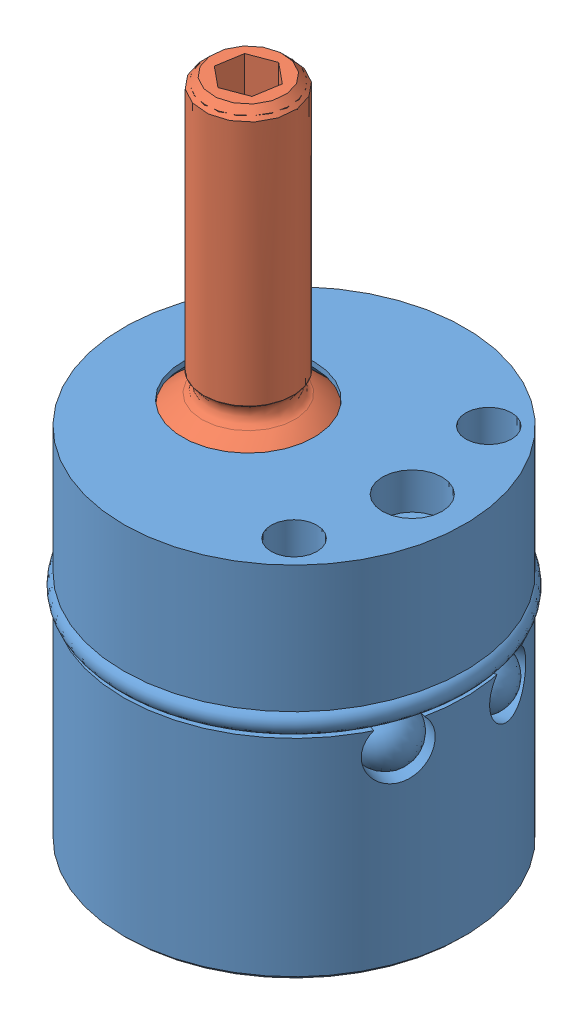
SolidWorks assembly ILC66091504.SLDASM, configuration Default (file format 5000). Lengths in mm.
Overall size (25.24 44.5 24.26).
2 component instances, 2 part files, 2 mates.
Components (placement in the parent):
- ILC66091504_BODY-1: ILC66091504_BODY.sldprt [Default] at (-2.9646 -12.5157 1.089) size (24.47 26.26 24.26)
- ILC66091504_PIVOT-1: ILC66091504_PIVOT.sldprt [Default] at (-6.1396 6.5851 1.089) x (-0.633993 0 0.773339) z (-0.773339 0 -0.633993) size (13.83 26.23 13.77)
Mates (geometry in assembly coordinates):
- Coincident1: coincident: axis of ILC66091504_BODY-1 through (-6.1396 12.4779 1.089) axis (0 -1 0); axis of ILC66091504_PIVOT-1 through (-6.1396 31.3501 1.089) axis (0 -1 0)
- Coincident2: coincident: plane of ILC66091504_BODY-1 through (-6.1396 6.5851 1.089) normal (0 1 0); plane of ILC66091504_PIVOT-1 through (-6.1396 6.5851 1.089) normal (0 -1 0)
